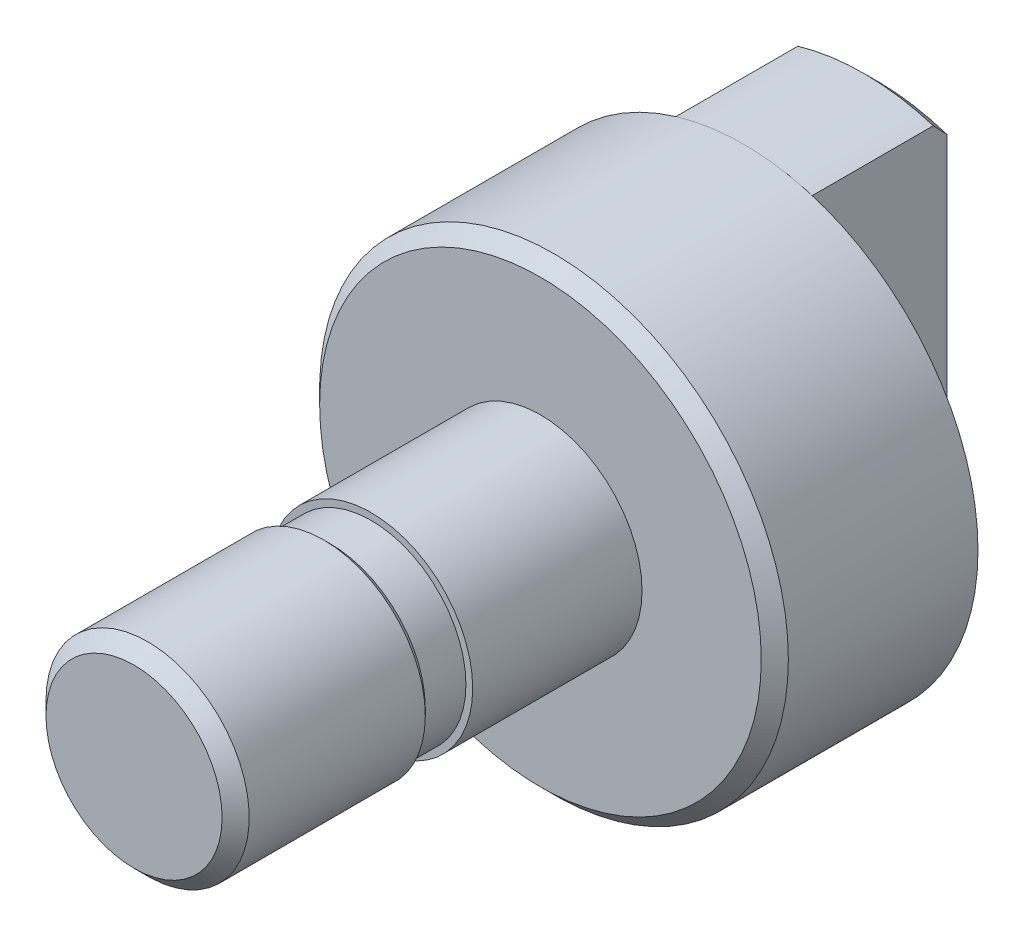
ISO-10303-21;
HEADER;
FILE_DESCRIPTION(('STEP AP214'),'2;1');
FILE_NAME('part.step','',(''),(''),'','','');
FILE_SCHEMA(('AUTOMOTIVE_DESIGN { 1 0 10303 214 1 1 1 1 }'));
ENDSEC;
DATA;
#1=APPLICATION_CONTEXT('core data for automotive mechanical design processes');
#2=APPLICATION_PROTOCOL_DEFINITION('international standard','automotive_design',2000,#1);
#3=PRODUCT_CONTEXT('',#1,'mechanical');
#4=PRODUCT('Part','Part','',(#3));
#5=PRODUCT_RELATED_PRODUCT_CATEGORY('part','',(#4));
#6=PRODUCT_DEFINITION_FORMATION('','',#4);
#7=PRODUCT_DEFINITION_CONTEXT('part definition',#1,'design');
#8=PRODUCT_DEFINITION('design','',#6,#7);
#9=PRODUCT_DEFINITION_SHAPE('','',#8);
#10=(LENGTH_UNIT() NAMED_UNIT(*) SI_UNIT(.MILLI.,.METRE.));
#11=(NAMED_UNIT(*) PLANE_ANGLE_UNIT() SI_UNIT($,.RADIAN.));
#12=(NAMED_UNIT(*) SI_UNIT($,.STERADIAN.) SOLID_ANGLE_UNIT());
#13=UNCERTAINTY_MEASURE_WITH_UNIT(LENGTH_MEASURE(1.E-05),#10,'distance_accuracy_value','');
#14=(GEOMETRIC_REPRESENTATION_CONTEXT(3) GLOBAL_UNCERTAINTY_ASSIGNED_CONTEXT((#13)) GLOBAL_UNIT_ASSIGNED_CONTEXT((#10,
#11,#12)) REPRESENTATION_CONTEXT('',''));
#15=CARTESIAN_POINT('',(0.,0.,0.));
#16=DIRECTION('',(0.,0.,1.));
#17=DIRECTION('',(1.,0.,0.));
#18=AXIS2_PLACEMENT_3D('',#15,#16,#17);
#19=CARTESIAN_POINT('',(0.,0.,0.));
#20=DIRECTION('',(0.,0.,1.));
#21=DIRECTION('',(1.,0.,0.));
#22=AXIS2_PLACEMENT_3D('',#19,#20,#21);
#23=PLANE('',#22);
#24=CARTESIAN_POINT('',(-0.176513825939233,0.,0.));
#25=DIRECTION('',(0.,0.,-1.));
#26=DIRECTION('',(-1.,0.,0.));
#27=AXIS2_PLACEMENT_3D('',#24,#25,#26);
#28=CIRCLE('',#27,21.920635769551);
#29=CARTESIAN_POINT('',(6.35,-20.9265116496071,0.));
#30=VERTEX_POINT('',#29);
#31=CARTESIAN_POINT('',(-6.35,-21.0333625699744,0.));
#32=VERTEX_POINT('',#31);
#33=EDGE_CURVE('E124',#30,#32,#28,.T.);
#34=ORIENTED_EDGE('',*,*,#33,.F.);
#35=DIRECTION('',(0.,-1.,0.));
#36=VECTOR('',#35,1.);
#37=CARTESIAN_POINT('',(6.35,-20.9265116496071,0.));
#38=LINE('',#37,#36);
#39=CARTESIAN_POINT('',(6.35,20.9265116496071,0.));
#40=VERTEX_POINT('',#39);
#41=EDGE_CURVE('E120',#40,#30,#38,.T.);
#42=ORIENTED_EDGE('',*,*,#41,.F.);
#43=CARTESIAN_POINT('',(-0.176513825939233,0.,0.));
#44=DIRECTION('',(0.,0.,-1.));
#45=DIRECTION('',(-1.,0.,0.));
#46=AXIS2_PLACEMENT_3D('',#43,#44,#45);
#47=CIRCLE('',#46,21.920635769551);
#48=CARTESIAN_POINT('',(-6.35,21.0333625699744,0.));
#49=VERTEX_POINT('',#48);
#50=EDGE_CURVE('E92',#49,#40,#47,.T.);
#51=ORIENTED_EDGE('',*,*,#50,.F.);
#52=CARTESIAN_POINT('',(0.,0.,0.));
#53=DIRECTION('',(0.,0.,1.));
#54=DIRECTION('',(1.,0.,0.));
#55=AXIS2_PLACEMENT_3D('',#52,#53,#54);
#56=CIRCLE('',#55,21.971);
#57=EDGE_CURVE('E112',#32,#49,#56,.T.);
#58=ORIENTED_EDGE('',*,*,#57,.F.);
#59=EDGE_LOOP('',(#34,#42,#51,#58));
#60=FACE_BOUND('',#59,.T.);
#61=ADVANCED_FACE('F34',(#60),#23,.F.);
#62=DIRECTION('',(0.,1.,0.));
#63=VECTOR('',#62,1.);
#64=CARTESIAN_POINT('',(-6.35,-21.0333625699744,0.));
#65=LINE('',#64,#63);
#66=EDGE_CURVE('E107',#32,#49,#65,.T.);
#67=ORIENTED_EDGE('',*,*,#66,.F.);
#68=EDGE_CURVE('E104',#49,#32,#56,.T.);
#69=ORIENTED_EDGE('',*,*,#68,.F.);
#70=EDGE_LOOP('',(#67,#69));
#71=FACE_BOUND('',#70,.T.);
#72=ADVANCED_FACE('F106',(#71),#23,.F.);
#73=CARTESIAN_POINT('',(0.,0.,19.05));
#74=DIRECTION('',(0.,0.,-1.));
#75=DIRECTION('',(-1.,0.,0.));
#76=AXIS2_PLACEMENT_3D('',#73,#74,#75);
#77=CYLINDRICAL_SURFACE('',#76,21.971);
#78=CARTESIAN_POINT('',(0.,0.,17.78));
#79=DIRECTION('',(0.,0.,1.));
#80=DIRECTION('',(1.,0.,0.));
#81=AXIS2_PLACEMENT_3D('',#78,#79,#80);
#82=CIRCLE('',#81,21.971);
#83=CARTESIAN_POINT('',(21.971,0.,17.78));
#84=VERTEX_POINT('',#83);
#85=EDGE_CURVE('E146',#84,#84,#82,.F.);
#86=ORIENTED_EDGE('',*,*,#85,.T.);
#87=EDGE_LOOP('',(#86));
#88=FACE_BOUND('',#87,.T.);
#89=ORIENTED_EDGE('',*,*,#68,.T.);
#90=ORIENTED_EDGE('',*,*,#57,.T.);
#91=EDGE_LOOP('',(#89,#90));
#92=FACE_BOUND('',#91,.T.);
#93=ADVANCED_FACE('F114',(#88,#92),#77,.T.);
#94=CARTESIAN_POINT('',(0.,0.,19.05));
#95=DIRECTION('',(0.,0.,1.));
#96=DIRECTION('',(1.,0.,0.));
#97=AXIS2_PLACEMENT_3D('',#94,#95,#96);
#98=PLANE('',#97);
#99=CARTESIAN_POINT('',(0.,0.,19.05));
#100=DIRECTION('',(0.,0.,1.));
#101=DIRECTION('',(1.,0.,0.));
#102=AXIS2_PLACEMENT_3D('',#99,#100,#101);
#103=CIRCLE('',#102,20.701);
#104=CARTESIAN_POINT('',(20.701,0.,19.05));
#105=VERTEX_POINT('',#104);
#106=EDGE_CURVE('E111',#105,#105,#103,.T.);
#107=ORIENTED_EDGE('',*,*,#106,.T.);
#108=EDGE_LOOP('',(#107));
#109=FACE_BOUND('',#108,.T.);
#110=CARTESIAN_POINT('',(0.,0.,19.05));
#111=DIRECTION('',(0.,0.,1.));
#112=DIRECTION('',(1.,0.,0.));
#113=AXIS2_PLACEMENT_3D('',#110,#111,#112);
#114=CIRCLE('',#113,9.525);
#115=CARTESIAN_POINT('',(9.525,0.,19.05));
#116=VERTEX_POINT('',#115);
#117=EDGE_CURVE('E139',#116,#116,#114,.T.);
#118=ORIENTED_EDGE('',*,*,#117,.F.);
#119=EDGE_LOOP('',(#118));
#120=FACE_BOUND('',#119,.T.);
#121=ADVANCED_FACE('F199',(#109,#120),#98,.T.);
#122=CARTESIAN_POINT('',(0.,0.,34.925));
#123=DIRECTION('',(0.,0.,-1.));
#124=DIRECTION('',(-1.,0.,0.));
#125=AXIS2_PLACEMENT_3D('',#122,#123,#124);
#126=CYLINDRICAL_SURFACE('',#125,9.525);
#127=CARTESIAN_POINT('',(0.,0.,34.925));
#128=DIRECTION('',(0.,0.,1.));
#129=DIRECTION('',(1.,0.,0.));
#130=AXIS2_PLACEMENT_3D('',#127,#128,#129);
#131=CIRCLE('',#130,9.525);
#132=CARTESIAN_POINT('',(9.525,0.,34.925));
#133=VERTEX_POINT('',#132);
#134=EDGE_CURVE('E117',#133,#133,#131,.T.);
#135=ORIENTED_EDGE('',*,*,#134,.F.);
#136=EDGE_LOOP('',(#135));
#137=FACE_BOUND('',#136,.T.);
#138=ORIENTED_EDGE('',*,*,#117,.T.);
#139=EDGE_LOOP('',(#138));
#140=FACE_BOUND('',#139,.T.);
#141=ADVANCED_FACE('F195',(#137,#140),#126,.T.);
#142=CARTESIAN_POINT('',(0.,0.,34.925));
#143=DIRECTION('',(0.,0.,1.));
#144=DIRECTION('',(1.,0.,0.));
#145=AXIS2_PLACEMENT_3D('',#142,#143,#144);
#146=PLANE('',#145);
#147=CARTESIAN_POINT('',(0.,0.,34.925));
#148=DIRECTION('',(0.,0.,1.));
#149=DIRECTION('',(1.,0.,0.));
#150=AXIS2_PLACEMENT_3D('',#147,#148,#149);
#151=CIRCLE('',#150,8.89);
#152=CARTESIAN_POINT('',(8.89,0.,34.925));
#153=VERTEX_POINT('',#152);
#154=EDGE_CURVE('E136',#153,#153,#151,.T.);
#155=ORIENTED_EDGE('',*,*,#154,.F.);
#156=EDGE_LOOP('',(#155));
#157=FACE_BOUND('',#156,.T.);
#158=ORIENTED_EDGE('',*,*,#134,.T.);
#159=EDGE_LOOP('',(#158));
#160=FACE_BOUND('',#159,.T.);
#161=ADVANCED_FACE('F191',(#157,#160),#146,.T.);
#162=CARTESIAN_POINT('',(0.,0.,38.1));
#163=DIRECTION('',(0.,0.,-1.));
#164=DIRECTION('',(-1.,0.,0.));
#165=AXIS2_PLACEMENT_3D('',#162,#163,#164);
#166=CYLINDRICAL_SURFACE('',#165,8.89);
#167=CARTESIAN_POINT('',(0.,0.,38.735));
#168=DIRECTION('',(0.,0.,1.));
#169=DIRECTION('',(1.,0.,0.));
#170=AXIS2_PLACEMENT_3D('',#167,#168,#169);
#171=CIRCLE('',#170,8.89);
#172=CARTESIAN_POINT('',(8.89,0.,38.735));
#173=VERTEX_POINT('',#172);
#174=EDGE_CURVE('E11',#173,#173,#171,.F.);
#175=ORIENTED_EDGE('',*,*,#174,.T.);
#176=EDGE_LOOP('',(#175));
#177=FACE_BOUND('',#176,.T.);
#178=ORIENTED_EDGE('',*,*,#154,.T.);
#179=EDGE_LOOP('',(#178));
#180=FACE_BOUND('',#179,.T.);
#181=ADVANCED_FACE('F187',(#177,#180),#166,.T.);
#182=CARTESIAN_POINT('',(0.,0.,57.15));
#183=DIRECTION('',(0.,0.,-1.));
#184=DIRECTION('',(-1.,0.,0.));
#185=AXIS2_PLACEMENT_3D('',#182,#183,#184);
#186=CYLINDRICAL_SURFACE('',#185,9.525);
#187=CARTESIAN_POINT('',(0.,0.,55.88));
#188=DIRECTION('',(0.,0.,1.));
#189=DIRECTION('',(1.,0.,0.));
#190=AXIS2_PLACEMENT_3D('',#187,#188,#189);
#191=CIRCLE('',#190,9.525);
#192=CARTESIAN_POINT('',(-9.525,0.,55.88));
#193=VERTEX_POINT('',#192);
#194=EDGE_CURVE('E42',#193,#193,#191,.F.);
#195=CARTESIAN_POINT('',(0.,0.,39.37));
#196=DIRECTION('',(0.,0.,1.));
#197=DIRECTION('',(1.,0.,0.));
#198=AXIS2_PLACEMENT_3D('',#195,#196,#197);
#199=CIRCLE('',#198,9.525);
#200=CARTESIAN_POINT('',(-9.525,0.,39.37));
#201=VERTEX_POINT('',#200);
#202=EDGE_CURVE('E245',#201,#201,#199,.T.);
#203=CARTESIAN_POINT('',(-9.525,0.,55.88));
#204=CARTESIAN_POINT('',(-9.525,0.,55.7080208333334));
#205=CARTESIAN_POINT('',(-9.525,0.,55.5360416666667));
#206=CARTESIAN_POINT('',(-9.525,0.,55.1920833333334));
#207=CARTESIAN_POINT('',(-9.525,0.,55.0201041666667));
#208=CARTESIAN_POINT('',(-9.525,0.,54.6761458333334));
#209=CARTESIAN_POINT('',(-9.525,0.,54.5041666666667));
#210=CARTESIAN_POINT('',(-9.525,0.,54.1602083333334));
#211=CARTESIAN_POINT('',(-9.525,0.,53.9882291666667));
#212=CARTESIAN_POINT('',(-9.525,0.,53.6442708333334));
#213=CARTESIAN_POINT('',(-9.525,0.,53.4722916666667));
#214=CARTESIAN_POINT('',(-9.525,0.,53.1283333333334));
#215=CARTESIAN_POINT('',(-9.525,0.,52.9563541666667));
#216=CARTESIAN_POINT('',(-9.525,0.,52.6123958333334));
#217=CARTESIAN_POINT('',(-9.525,0.,52.4404166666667));
#218=CARTESIAN_POINT('',(-9.525,0.,52.0964583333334));
#219=CARTESIAN_POINT('',(-9.525,0.,51.9244791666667));
#220=CARTESIAN_POINT('',(-9.525,0.,51.5805208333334));
#221=CARTESIAN_POINT('',(-9.525,0.,51.4085416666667));
#222=CARTESIAN_POINT('',(-9.525,0.,51.0645833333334));
#223=CARTESIAN_POINT('',(-9.525,0.,50.8926041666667));
#224=CARTESIAN_POINT('',(-9.525,0.,50.5486458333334));
#225=CARTESIAN_POINT('',(-9.525,0.,50.3766666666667));
#226=CARTESIAN_POINT('',(-9.525,0.,50.0327083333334));
#227=CARTESIAN_POINT('',(-9.525,0.,49.8607291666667));
#228=CARTESIAN_POINT('',(-9.525,0.,49.5167708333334));
#229=CARTESIAN_POINT('',(-9.525,0.,49.3447916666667));
#230=CARTESIAN_POINT('',(-9.525,0.,49.0008333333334));
#231=CARTESIAN_POINT('',(-9.525,0.,48.8288541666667));
#232=CARTESIAN_POINT('',(-9.525,0.,48.4848958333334));
#233=CARTESIAN_POINT('',(-9.525,0.,48.3129166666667));
#234=CARTESIAN_POINT('',(-9.525,0.,47.9689583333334));
#235=CARTESIAN_POINT('',(-9.525,0.,47.7969791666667));
#236=CARTESIAN_POINT('',(-9.525,0.,47.4530208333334));
#237=CARTESIAN_POINT('',(-9.525,0.,47.2810416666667));
#238=CARTESIAN_POINT('',(-9.525,0.,46.9370833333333));
#239=CARTESIAN_POINT('',(-9.525,0.,46.7651041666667));
#240=CARTESIAN_POINT('',(-9.525,0.,46.4211458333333));
#241=CARTESIAN_POINT('',(-9.525,0.,46.2491666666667));
#242=CARTESIAN_POINT('',(-9.525,0.,45.9052083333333));
#243=CARTESIAN_POINT('',(-9.525,0.,45.7332291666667));
#244=CARTESIAN_POINT('',(-9.525,0.,45.3892708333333));
#245=CARTESIAN_POINT('',(-9.525,0.,45.2172916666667));
#246=CARTESIAN_POINT('',(-9.525,0.,44.8733333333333));
#247=CARTESIAN_POINT('',(-9.525,0.,44.7013541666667));
#248=CARTESIAN_POINT('',(-9.525,0.,44.3573958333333));
#249=CARTESIAN_POINT('',(-9.525,0.,44.1854166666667));
#250=CARTESIAN_POINT('',(-9.525,0.,43.8414583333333));
#251=CARTESIAN_POINT('',(-9.525,0.,43.6694791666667));
#252=CARTESIAN_POINT('',(-9.525,0.,43.3255208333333));
#253=CARTESIAN_POINT('',(-9.525,0.,43.1535416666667));
#254=CARTESIAN_POINT('',(-9.525,0.,42.8095833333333));
#255=CARTESIAN_POINT('',(-9.525,0.,42.6376041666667));
#256=CARTESIAN_POINT('',(-9.525,0.,42.2936458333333));
#257=CARTESIAN_POINT('',(-9.525,0.,42.1216666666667));
#258=CARTESIAN_POINT('',(-9.525,0.,41.7777083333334));
#259=CARTESIAN_POINT('',(-9.525,0.,41.6057291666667));
#260=CARTESIAN_POINT('',(-9.525,0.,41.2617708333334));
#261=CARTESIAN_POINT('',(-9.525,0.,41.0897916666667));
#262=CARTESIAN_POINT('',(-9.525,0.,40.7458333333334));
#263=CARTESIAN_POINT('',(-9.525,0.,40.5738541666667));
#264=CARTESIAN_POINT('',(-9.525,0.,40.2298958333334));
#265=CARTESIAN_POINT('',(-9.525,0.,40.0579166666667));
#266=CARTESIAN_POINT('',(-9.525,0.,39.7139583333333));
#267=CARTESIAN_POINT('',(-9.525,0.,39.5419791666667));
#268=CARTESIAN_POINT('',(-9.525,0.,39.37));
#269=B_SPLINE_CURVE_WITH_KNOTS('',3,(#203,#204,#205,#206,#207,#208,#209,#210,#211,#212,#213,
#214,#215,#216,#217,#218,#219,#220,#221,#222,#223,#224,#225,#226,#227,#228,#229,#230,#231,#232,
#233,#234,#235,#236,#237,#238,#239,#240,#241,#242,#243,#244,#245,#246,#247,#248,#249,#250,#251,
#252,#253,#254,#255,#256,#257,#258,#259,#260,#261,#262,#263,#264,#265,#266,#267,#268),
.UNSPECIFIED.,.F.,.F.,(4,2,2,2,2,2,2,2,2,2,2,2,2,2,2,2,2,2,2,2,2,2,2,2,2,2,2,2,2,2,2,2,4),(0.,
0.515937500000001,1.031875,1.5478125,2.06375,2.5796875,3.095625,3.61156250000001,
4.12750000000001,4.64343750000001,5.15937500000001,5.67531250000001,6.19125000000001,
6.70718750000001,7.22312500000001,7.73906250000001,8.25500000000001,8.77093750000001,
9.28687500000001,9.80281250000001,10.31875,10.8346875,11.350625,11.8665625,12.3825,12.8984375,
13.414375,13.9303125,14.44625,14.9621875,15.478125,15.9940625,16.51),.UNSPECIFIED.);
#270=EDGE_CURVE('BSEAM183',#193,#201,#269,.T.);
#271=ORIENTED_EDGE('',*,*,#194,.T.);
#272=ORIENTED_EDGE('',*,*,#202,.T.);
#273=ORIENTED_EDGE('',*,*,#270,.T.);
#274=ORIENTED_EDGE('',*,*,#270,.F.);
#275=EDGE_LOOP('',(#271,#273,#272,#274));
#276=FACE_BOUND('',#275,.T.);
#277=ADVANCED_FACE('F183',(#276),#186,.T.);
#278=CARTESIAN_POINT('',(0.,0.,57.15));
#279=DIRECTION('',(0.,0.,1.));
#280=DIRECTION('',(1.,0.,0.));
#281=AXIS2_PLACEMENT_3D('',#278,#279,#280);
#282=PLANE('',#281);
#283=CARTESIAN_POINT('',(0.,0.,57.15));
#284=DIRECTION('',(0.,0.,1.));
#285=DIRECTION('',(1.,0.,0.));
#286=AXIS2_PLACEMENT_3D('',#283,#284,#285);
#287=CIRCLE('',#286,8.25500000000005);
#288=CARTESIAN_POINT('',(8.25500000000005,0.,57.15));
#289=VERTEX_POINT('',#288);
#290=EDGE_CURVE('E243',#289,#289,#287,.T.);
#291=ORIENTED_EDGE('',*,*,#290,.T.);
#292=EDGE_LOOP('',(#291));
#293=FACE_BOUND('',#292,.T.);
#294=ADVANCED_FACE('F180',(#293),#282,.T.);
#295=CARTESIAN_POINT('',(0.,0.,19.05));
#296=DIRECTION('',(0.,0.,-1.));
#297=DIRECTION('',(-1.,0.,0.));
#298=AXIS2_PLACEMENT_3D('',#295,#296,#297);
#299=CONICAL_SURFACE('',#298,20.701,0.785398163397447);
#300=ORIENTED_EDGE('',*,*,#85,.F.);
#301=EDGE_LOOP('',(#300));
#302=FACE_BOUND('',#301,.T.);
#303=ORIENTED_EDGE('',*,*,#106,.F.);
#304=EDGE_LOOP('',(#303));
#305=FACE_BOUND('',#304,.T.);
#306=ADVANCED_FACE('F179',(#302,#305),#299,.T.);
#307=CARTESIAN_POINT('',(-0.176513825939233,0.,-12.7));
#308=DIRECTION('',(0.,0.,1.));
#309=DIRECTION('',(1.,0.,0.));
#310=AXIS2_PLACEMENT_3D('',#307,#308,#309);
#311=CYLINDRICAL_SURFACE('',#310,21.920635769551);
#312=DIRECTION('',(0.,0.,1.));
#313=VECTOR('',#312,1.);
#314=CARTESIAN_POINT('',(-6.35,-21.0333625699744,-12.7));
#315=LINE('',#314,#313);
#316=CARTESIAN_POINT('',(-6.35,-21.0333625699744,-11.43));
#317=VERTEX_POINT('',#316);
#318=EDGE_CURVE('E98',#317,#32,#315,.T.);
#319=ORIENTED_EDGE('',*,*,#318,.F.);
#320=CARTESIAN_POINT('',(-0.176513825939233,0.,-11.43));
#321=DIRECTION('',(0.,0.,-1.));
#322=DIRECTION('',(-1.,0.,0.));
#323=AXIS2_PLACEMENT_3D('',#320,#321,#322);
#324=CIRCLE('',#323,21.920635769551);
#325=CARTESIAN_POINT('',(6.35,-20.9265116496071,-11.43));
#326=VERTEX_POINT('',#325);
#327=EDGE_CURVE('E57',#317,#326,#324,.F.);
#328=ORIENTED_EDGE('',*,*,#327,.T.);
#329=DIRECTION('',(0.,0.,1.));
#330=VECTOR('',#329,1.);
#331=CARTESIAN_POINT('',(6.35,-20.9265116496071,-12.7));
#332=LINE('',#331,#330);
#333=EDGE_CURVE('E131',#326,#30,#332,.T.);
#334=ORIENTED_EDGE('',*,*,#333,.T.);
#335=ORIENTED_EDGE('',*,*,#33,.T.);
#336=EDGE_LOOP('',(#319,#328,#334,#335));
#337=FACE_BOUND('',#336,.T.);
#338=ADVANCED_FACE('F174',(#337),#311,.T.);
#339=CARTESIAN_POINT('',(-6.35,-21.0333625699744,-12.7));
#340=DIRECTION('',(1.,0.,0.));
#341=DIRECTION('',(0.,1.,0.));
#342=AXIS2_PLACEMENT_3D('',#339,#340,#341);
#343=PLANE('',#342);
#344=DIRECTION('',(0.,1.,0.));
#345=VECTOR('',#344,1.);
#346=CARTESIAN_POINT('',(-6.35,-21.0333625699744,-12.7));
#347=LINE('',#346,#345);
#348=CARTESIAN_POINT('',(-6.35,-19.7062636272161,-12.7));
#349=VERTEX_POINT('',#348);
#350=CARTESIAN_POINT('',(-6.35,19.7062636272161,-12.7));
#351=VERTEX_POINT('',#350);
#352=EDGE_CURVE('E130',#349,#351,#347,.T.);
#353=ORIENTED_EDGE('',*,*,#352,.F.);
#354=CARTESIAN_POINT('',(-6.35,-19.7062636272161,-12.7));
#355=CARTESIAN_POINT('',(-6.35,-19.9277367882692,-12.4886363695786));
#356=CARTESIAN_POINT('',(-6.35,-20.1490649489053,-12.2771212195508));
#357=CARTESIAN_POINT('',(-6.35,-20.5914312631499,-11.853787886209));
#358=CARTESIAN_POINT('',(-6.35,-20.8124694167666,-11.6419697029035));
#359=CARTESIAN_POINT('',(-6.35,-21.0333625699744,-11.43));
#360=B_SPLINE_CURVE_WITH_KNOTS('',3,(#354,#355,#356,#357,#358,#359),.UNSPECIFIED.,.F.,.F.,(4,2,
4),(0.,0.918435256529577,1.83687048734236),.UNSPECIFIED.);
#361=EDGE_CURVE('E162',#349,#317,#360,.T.);
#362=ORIENTED_EDGE('',*,*,#361,.T.);
#363=ORIENTED_EDGE('',*,*,#318,.T.);
#364=ORIENTED_EDGE('',*,*,#66,.T.);
#365=DIRECTION('',(0.,0.,1.));
#366=VECTOR('',#365,1.);
#367=CARTESIAN_POINT('',(-6.35,21.0333625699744,-12.7));
#368=LINE('',#367,#366);
#369=CARTESIAN_POINT('',(-6.35,21.0333625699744,-11.43));
#370=VERTEX_POINT('',#369);
#371=EDGE_CURVE('E88',#370,#49,#368,.T.);
#372=ORIENTED_EDGE('',*,*,#371,.F.);
#373=CARTESIAN_POINT('',(-6.35,21.0333625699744,-11.43));
#374=CARTESIAN_POINT('',(-6.35,20.8124694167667,-11.6419697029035));
#375=CARTESIAN_POINT('',(-6.35,20.59143126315,-11.853787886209));
#376=CARTESIAN_POINT('',(-6.35,20.1490649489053,-12.2771212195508));
#377=CARTESIAN_POINT('',(-6.35,19.9277367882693,-12.4886363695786));
#378=CARTESIAN_POINT('',(-6.35,19.7062636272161,-12.7));
#379=B_SPLINE_CURVE_WITH_KNOTS('',3,(#373,#374,#375,#376,#377,#378),.UNSPECIFIED.,.F.,.F.,(4,2,
4),(0.,0.918435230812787,1.83687048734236),.UNSPECIFIED.);
#380=EDGE_CURVE('E155',#370,#351,#379,.T.);
#381=ORIENTED_EDGE('',*,*,#380,.T.);
#382=EDGE_LOOP('',(#353,#362,#363,#364,#372,#381));
#383=FACE_BOUND('',#382,.T.);
#384=ADVANCED_FACE('F123',(#383),#343,.F.);
#385=CARTESIAN_POINT('',(-0.176513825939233,0.,-12.7));
#386=DIRECTION('',(0.,0.,1.));
#387=DIRECTION('',(1.,0.,0.));
#388=AXIS2_PLACEMENT_3D('',#385,#386,#387);
#389=CYLINDRICAL_SURFACE('',#388,21.920635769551);
#390=DIRECTION('',(0.,0.,1.));
#391=VECTOR('',#390,1.);
#392=CARTESIAN_POINT('',(6.35,20.9265116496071,-12.7));
#393=LINE('',#392,#391);
#394=CARTESIAN_POINT('',(6.35,20.9265116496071,-11.43));
#395=VERTEX_POINT('',#394);
#396=EDGE_CURVE('E99',#395,#40,#393,.T.);
#397=ORIENTED_EDGE('',*,*,#396,.F.);
#398=CARTESIAN_POINT('',(-0.176513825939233,0.,-11.43));
#399=DIRECTION('',(0.,0.,-1.));
#400=DIRECTION('',(-1.,0.,0.));
#401=AXIS2_PLACEMENT_3D('',#398,#399,#400);
#402=CIRCLE('',#401,21.920635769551);
#403=EDGE_CURVE('E94',#395,#370,#402,.F.);
#404=ORIENTED_EDGE('',*,*,#403,.T.);
#405=ORIENTED_EDGE('',*,*,#371,.T.);
#406=ORIENTED_EDGE('',*,*,#50,.T.);
#407=EDGE_LOOP('',(#397,#404,#405,#406));
#408=FACE_BOUND('',#407,.T.);
#409=ADVANCED_FACE('F90',(#408),#389,.T.);
#410=CARTESIAN_POINT('',(6.35,-20.9265116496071,-12.7));
#411=DIRECTION('',(-1.,0.,0.));
#412=DIRECTION('',(0.,0.,1.));
#413=AXIS2_PLACEMENT_3D('',#410,#411,#412);
#414=PLANE('',#413);
#415=ORIENTED_EDGE('',*,*,#333,.F.);
#416=CARTESIAN_POINT('',(6.35,-20.9265116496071,-11.43));
#417=CARTESIAN_POINT('',(6.35,-20.7044500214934,-11.6420108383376));
#418=CARTESIAN_POINT('',(6.35,-20.4822246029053,-11.8538495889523));
#419=CARTESIAN_POINT('',(6.35,-20.0374461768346,-12.2771829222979));
#420=CARTESIAN_POINT('',(6.35,-19.8148931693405,-12.4886775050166));
#421=CARTESIAN_POINT('',(6.35,-19.5921763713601,-12.7));
#422=B_SPLINE_CURVE_WITH_KNOTS('',3,(#416,#417,#418,#419,#420,#421),.UNSPECIFIED.,.F.,.F.,(4,2,
4),(0.,0.921052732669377,1.84210549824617),.UNSPECIFIED.);
#423=CARTESIAN_POINT('',(6.35,-19.5921763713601,-12.7));
#424=VERTEX_POINT('',#423);
#425=EDGE_CURVE('E218',#326,#424,#422,.T.);
#426=ORIENTED_EDGE('',*,*,#425,.T.);
#427=DIRECTION('',(0.,-1.,0.));
#428=VECTOR('',#427,1.);
#429=CARTESIAN_POINT('',(6.35,-20.9265116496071,-12.7));
#430=LINE('',#429,#428);
#431=CARTESIAN_POINT('',(6.35,19.5921763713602,-12.7));
#432=VERTEX_POINT('',#431);
#433=EDGE_CURVE('E133',#432,#424,#430,.T.);
#434=ORIENTED_EDGE('',*,*,#433,.F.);
#435=CARTESIAN_POINT('',(6.35,19.5921763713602,-12.7));
#436=CARTESIAN_POINT('',(6.35,19.8148931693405,-12.4886775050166));
#437=CARTESIAN_POINT('',(6.35,20.0374461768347,-12.2771829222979));
#438=CARTESIAN_POINT('',(6.35,20.4822246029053,-11.8538495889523));
#439=CARTESIAN_POINT('',(6.35,20.7044500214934,-11.6420108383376));
#440=CARTESIAN_POINT('',(6.35,20.9265116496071,-11.43));
#441=B_SPLINE_CURVE_WITH_KNOTS('',3,(#435,#436,#437,#438,#439,#440),.UNSPECIFIED.,.F.,.F.,(4,2,
4),(0.,0.921052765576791,1.84210549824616),.UNSPECIFIED.);
#442=EDGE_CURVE('E49',#432,#395,#441,.T.);
#443=ORIENTED_EDGE('',*,*,#442,.T.);
#444=ORIENTED_EDGE('',*,*,#396,.T.);
#445=ORIENTED_EDGE('',*,*,#41,.T.);
#446=EDGE_LOOP('',(#415,#426,#434,#443,#444,#445));
#447=FACE_BOUND('',#446,.T.);
#448=ADVANCED_FACE('F228',(#447),#414,.F.);
#449=CARTESIAN_POINT('',(-0.176513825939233,0.,-12.7));
#450=DIRECTION('',(0.,0.,-1.));
#451=DIRECTION('',(-1.,0.,0.));
#452=AXIS2_PLACEMENT_3D('',#449,#450,#451);
#453=PLANE('',#452);
#454=ORIENTED_EDGE('',*,*,#433,.T.);
#455=CARTESIAN_POINT('',(-0.176513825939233,0.,-12.7));
#456=DIRECTION('',(0.,0.,-1.));
#457=DIRECTION('',(-1.,0.,0.));
#458=AXIS2_PLACEMENT_3D('',#455,#456,#457);
#459=CIRCLE('',#458,20.650635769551);
#460=EDGE_CURVE('E152',#424,#349,#459,.T.);
#461=ORIENTED_EDGE('',*,*,#460,.T.);
#462=ORIENTED_EDGE('',*,*,#352,.T.);
#463=CARTESIAN_POINT('',(-0.176513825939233,0.,-12.7));
#464=DIRECTION('',(0.,0.,-1.));
#465=DIRECTION('',(-1.,0.,0.));
#466=AXIS2_PLACEMENT_3D('',#463,#464,#465);
#467=CIRCLE('',#466,20.650635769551);
#468=EDGE_CURVE('E149',#351,#432,#467,.T.);
#469=ORIENTED_EDGE('',*,*,#468,.T.);
#470=EDGE_LOOP('',(#454,#461,#462,#469));
#471=FACE_BOUND('',#470,.T.);
#472=ADVANCED_FACE('F214',(#471),#453,.T.);
#473=CARTESIAN_POINT('',(-0.176513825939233,0.,-12.7));
#474=DIRECTION('',(0.,0.,1.));
#475=DIRECTION('',(1.,0.,0.));
#476=AXIS2_PLACEMENT_3D('',#473,#474,#475);
#477=CONICAL_SURFACE('',#476,20.650635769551,0.78539816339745);
#478=ORIENTED_EDGE('',*,*,#425,.F.);
#479=ORIENTED_EDGE('',*,*,#327,.F.);
#480=ORIENTED_EDGE('',*,*,#361,.F.);
#481=ORIENTED_EDGE('',*,*,#460,.F.);
#482=EDGE_LOOP('',(#478,#479,#480,#481));
#483=FACE_BOUND('',#482,.T.);
#484=ADVANCED_FACE('F211',(#483),#477,.T.);
#485=CARTESIAN_POINT('',(-0.176513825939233,0.,-12.7));
#486=DIRECTION('',(0.,0.,1.));
#487=DIRECTION('',(1.,0.,0.));
#488=AXIS2_PLACEMENT_3D('',#485,#486,#487);
#489=CONICAL_SURFACE('',#488,20.650635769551,0.78539816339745);
#490=ORIENTED_EDGE('',*,*,#380,.F.);
#491=ORIENTED_EDGE('',*,*,#403,.F.);
#492=ORIENTED_EDGE('',*,*,#442,.F.);
#493=ORIENTED_EDGE('',*,*,#468,.F.);
#494=EDGE_LOOP('',(#490,#491,#492,#493));
#495=FACE_BOUND('',#494,.T.);
#496=ADVANCED_FACE('F168',(#495),#489,.T.);
#497=CARTESIAN_POINT('',(0.,0.,57.15));
#498=DIRECTION('',(0.,0.,-1.));
#499=DIRECTION('',(-1.,0.,0.));
#500=AXIS2_PLACEMENT_3D('',#497,#498,#499);
#501=CONICAL_SURFACE('',#500,8.25500000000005,0.785398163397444);
#502=ORIENTED_EDGE('',*,*,#194,.F.);
#503=EDGE_LOOP('',(#502));
#504=FACE_BOUND('',#503,.T.);
#505=ORIENTED_EDGE('',*,*,#290,.F.);
#506=EDGE_LOOP('',(#505));
#507=FACE_BOUND('',#506,.T.);
#508=ADVANCED_FACE('F253',(#504,#507),#501,.T.);
#509=CARTESIAN_POINT('',(0.,0.,39.37));
#510=DIRECTION('',(0.,0.,1.));
#511=DIRECTION('',(1.,0.,0.));
#512=AXIS2_PLACEMENT_3D('',#509,#510,#511);
#513=CONICAL_SURFACE('',#512,9.525,0.785398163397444);
#514=ORIENTED_EDGE('',*,*,#174,.F.);
#515=EDGE_LOOP('',(#514));
#516=FACE_BOUND('',#515,.T.);
#517=ORIENTED_EDGE('',*,*,#202,.F.);
#518=EDGE_LOOP('',(#517));
#519=FACE_BOUND('',#518,.T.);
#520=ADVANCED_FACE('F36',(#516,#519),#513,.T.);
#521=CLOSED_SHELL('',(#61,#72,#93,#121,#141,#161,#181,#277,#294,#306,#338,#384,#409,#448,#472,
#484,#496,#508,#520));
#522=MANIFOLD_SOLID_BREP('B2',#521);
#523=ADVANCED_BREP_SHAPE_REPRESENTATION('',(#18,#522),#14);
#524=SHAPE_DEFINITION_REPRESENTATION(#9,#523);
ENDSEC;
END-ISO-10303-21;
